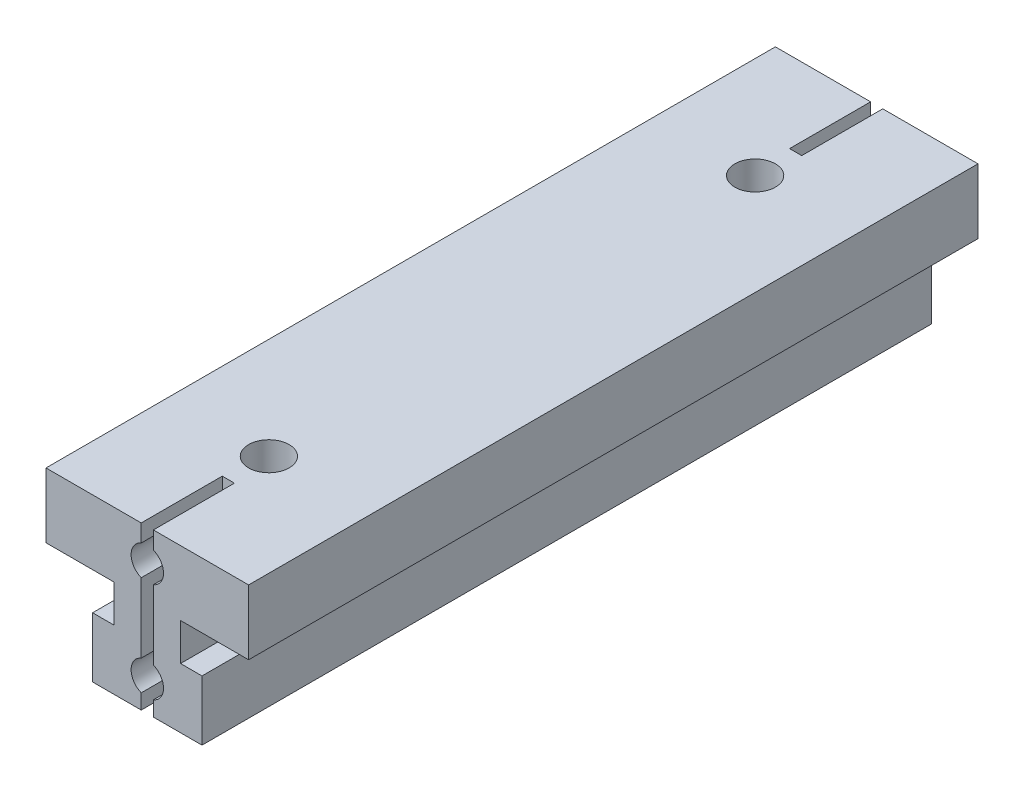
ISO-10303-21;
HEADER;
FILE_DESCRIPTION(('STEP AP214'),'2;1');
FILE_NAME('part.step','',(''),(''),'','','');
FILE_SCHEMA(('AUTOMOTIVE_DESIGN { 1 0 10303 214 1 1 1 1 }'));
ENDSEC;
DATA;
#1=APPLICATION_CONTEXT('core data for automotive mechanical design processes');
#2=APPLICATION_PROTOCOL_DEFINITION('international standard','automotive_design',2000,#1);
#3=PRODUCT_CONTEXT('',#1,'mechanical');
#4=PRODUCT('Part','Part','',(#3));
#5=PRODUCT_RELATED_PRODUCT_CATEGORY('part','',(#4));
#6=PRODUCT_DEFINITION_FORMATION('','',#4);
#7=PRODUCT_DEFINITION_CONTEXT('part definition',#1,'design');
#8=PRODUCT_DEFINITION('design','',#6,#7);
#9=PRODUCT_DEFINITION_SHAPE('','',#8);
#10=(LENGTH_UNIT() NAMED_UNIT(*) SI_UNIT(.MILLI.,.METRE.));
#11=(NAMED_UNIT(*) PLANE_ANGLE_UNIT() SI_UNIT($,.RADIAN.));
#12=(NAMED_UNIT(*) SI_UNIT($,.STERADIAN.) SOLID_ANGLE_UNIT());
#13=UNCERTAINTY_MEASURE_WITH_UNIT(LENGTH_MEASURE(1.E-05),#10,'distance_accuracy_value','');
#14=(GEOMETRIC_REPRESENTATION_CONTEXT(3) GLOBAL_UNCERTAINTY_ASSIGNED_CONTEXT((#13)) GLOBAL_UNIT_ASSIGNED_CONTEXT((#10,
#11,#12)) REPRESENTATION_CONTEXT('',''));
#15=CARTESIAN_POINT('',(0.,0.,0.));
#16=DIRECTION('',(0.,0.,1.));
#17=DIRECTION('',(1.,0.,0.));
#18=AXIS2_PLACEMENT_3D('',#15,#16,#17);
#19=CARTESIAN_POINT('',(-2.04,8.,-35.));
#20=DIRECTION('',(0.,0.,-1.));
#21=DIRECTION('',(1.,0.,0.));
#22=AXIS2_PLACEMENT_3D('',#19,#20,#21);
#23=PLANE('',#22);
#24=DIRECTION('',(0.,-1.,0.));
#25=VECTOR('',#24,1.);
#26=CARTESIAN_POINT('',(0.75,-2.14999961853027,-35.));
#27=LINE('',#26,#25);
#28=CARTESIAN_POINT('',(0.749999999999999,2.1459503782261,-35.));
#29=VERTEX_POINT('',#28);
#30=CARTESIAN_POINT('',(0.75,-6.44594961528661,-35.));
#31=VERTEX_POINT('',#30);
#32=EDGE_CURVE('E419',#29,#31,#27,.T.);
#33=ORIENTED_EDGE('',*,*,#32,.T.);
#34=CARTESIAN_POINT('',(0.,-8.2999992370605,-35.));
#35=DIRECTION('',(0.,0.,1.));
#36=DIRECTION('',(0.,-1.,0.));
#37=AXIS2_PLACEMENT_3D('',#34,#35,#36);
#38=CIRCLE('',#37,2.);
#39=CARTESIAN_POINT('',(0.749999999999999,-10.1540488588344,-35.));
#40=VERTEX_POINT('',#39);
#41=EDGE_CURVE('E319',#31,#40,#38,.F.);
#42=ORIENTED_EDGE('',*,*,#41,.T.);
#43=DIRECTION('',(0.,-1.,0.));
#44=VECTOR('',#43,1.);
#45=CARTESIAN_POINT('',(0.75,-11.0770244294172,-35.));
#46=LINE('',#45,#44);
#47=CARTESIAN_POINT('',(0.75,-12.,-35.));
#48=VERTEX_POINT('',#47);
#49=EDGE_CURVE('E417',#40,#48,#46,.T.);
#50=ORIENTED_EDGE('',*,*,#49,.T.);
#51=DIRECTION('',(1.,0.,0.));
#52=VECTOR('',#51,1.);
#53=CARTESIAN_POINT('',(6.75,-12.,-35.));
#54=LINE('',#53,#52);
#55=CARTESIAN_POINT('',(-0.75,-12.,-35.));
#56=VERTEX_POINT('',#55);
#57=EDGE_CURVE('E394',#56,#48,#54,.T.);
#58=ORIENTED_EDGE('',*,*,#57,.F.);
#59=DIRECTION('',(0.,1.,0.));
#60=VECTOR('',#59,1.);
#61=CARTESIAN_POINT('',(-0.75,-11.0770244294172,-35.));
#62=LINE('',#61,#60);
#63=CARTESIAN_POINT('',(-0.75,-10.1540488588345,-35.));
#64=VERTEX_POINT('',#63);
#65=EDGE_CURVE('E248',#56,#64,#62,.T.);
#66=ORIENTED_EDGE('',*,*,#65,.T.);
#67=CARTESIAN_POINT('',(0.,-8.29999923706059,-35.));
#68=DIRECTION('',(0.,0.,1.));
#69=DIRECTION('',(0.,-1.,0.));
#70=AXIS2_PLACEMENT_3D('',#67,#68,#69);
#71=CIRCLE('',#70,2.);
#72=CARTESIAN_POINT('',(-0.75,-6.44594961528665,-35.));
#73=VERTEX_POINT('',#72);
#74=EDGE_CURVE('E20',#64,#73,#71,.F.);
#75=ORIENTED_EDGE('',*,*,#74,.T.);
#76=DIRECTION('',(0.,1.,0.));
#77=VECTOR('',#76,1.);
#78=CARTESIAN_POINT('',(-0.75,-2.14999961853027,-35.));
#79=LINE('',#78,#77);
#80=CARTESIAN_POINT('',(-0.75,2.14595037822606,-35.));
#81=VERTEX_POINT('',#80);
#82=EDGE_CURVE('E253',#73,#81,#79,.T.);
#83=ORIENTED_EDGE('',*,*,#82,.T.);
#84=CARTESIAN_POINT('',(0.,3.99999999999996,-35.));
#85=DIRECTION('',(0.,0.,1.));
#86=DIRECTION('',(0.,-1.,0.));
#87=AXIS2_PLACEMENT_3D('',#84,#85,#86);
#88=CIRCLE('',#87,2.);
#89=CARTESIAN_POINT('',(-0.75,5.8540496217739,-35.));
#90=VERTEX_POINT('',#89);
#91=EDGE_CURVE('E271',#81,#90,#88,.F.);
#92=ORIENTED_EDGE('',*,*,#91,.T.);
#93=DIRECTION('',(0.,1.,0.));
#94=VECTOR('',#93,1.);
#95=CARTESIAN_POINT('',(-0.75,6.92702481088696,-35.));
#96=LINE('',#95,#94);
#97=CARTESIAN_POINT('',(-0.75,8.,-35.));
#98=VERTEX_POINT('',#97);
#99=EDGE_CURVE('E377',#90,#98,#96,.T.);
#100=ORIENTED_EDGE('',*,*,#99,.T.);
#101=DIRECTION('',(1.,0.,0.));
#102=VECTOR('',#101,1.);
#103=CARTESIAN_POINT('',(0.,8.,-35.));
#104=LINE('',#103,#102);
#105=CARTESIAN_POINT('',(0.75,8.,-35.));
#106=VERTEX_POINT('',#105);
#107=EDGE_CURVE('E401',#98,#106,#104,.T.);
#108=ORIENTED_EDGE('',*,*,#107,.T.);
#109=DIRECTION('',(0.,-1.,0.));
#110=VECTOR('',#109,1.);
#111=CARTESIAN_POINT('',(0.75,6.92702481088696,-35.));
#112=LINE('',#111,#110);
#113=CARTESIAN_POINT('',(0.75,5.85404962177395,-35.));
#114=VERTEX_POINT('',#113);
#115=EDGE_CURVE('E383',#106,#114,#112,.T.);
#116=ORIENTED_EDGE('',*,*,#115,.T.);
#117=CARTESIAN_POINT('',(0.,4.00000000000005,-35.));
#118=DIRECTION('',(0.,0.,1.));
#119=DIRECTION('',(0.,-1.,0.));
#120=AXIS2_PLACEMENT_3D('',#117,#118,#119);
#121=CIRCLE('',#120,2.);
#122=EDGE_CURVE('E323',#114,#29,#121,.F.);
#123=ORIENTED_EDGE('',*,*,#122,.T.);
#124=EDGE_LOOP('',(#33,#42,#50,#58,#66,#75,#83,#92,#100,#108,#116,#123));
#125=FACE_BOUND('',#124,.T.);
#126=ADVANCED_FACE('F16',(#125),#23,.T.);
#127=CARTESIAN_POINT('',(-0.75,-10.1540488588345,-35.));
#128=DIRECTION('',(-1.,0.,0.));
#129=DIRECTION('',(0.,0.,-1.));
#130=AXIS2_PLACEMENT_3D('',#127,#128,#129);
#131=PLANE('',#130);
#132=DIRECTION('',(0.,0.,-1.));
#133=VECTOR('',#132,1.);
#134=CARTESIAN_POINT('',(-0.75,-12.,0.));
#135=LINE('',#134,#133);
#136=CARTESIAN_POINT('',(-0.75,-12.,-45.));
#137=VERTEX_POINT('',#136);
#138=EDGE_CURVE('E391',#137,#56,#135,.F.);
#139=ORIENTED_EDGE('',*,*,#138,.F.);
#140=DIRECTION('',(0.,1.,0.));
#141=VECTOR('',#140,1.);
#142=CARTESIAN_POINT('',(-0.75,-0.659840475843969,-45.));
#143=LINE('',#142,#141);
#144=CARTESIAN_POINT('',(-0.75,-10.1540488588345,-45.));
#145=VERTEX_POINT('',#144);
#146=EDGE_CURVE('E318',#137,#145,#143,.T.);
#147=ORIENTED_EDGE('',*,*,#146,.T.);
#148=DIRECTION('',(0.,0.,1.));
#149=VECTOR('',#148,1.);
#150=CARTESIAN_POINT('',(-0.75,-10.1540488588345,-40.));
#151=LINE('',#150,#149);
#152=EDGE_CURVE('E258',#145,#64,#151,.T.);
#153=ORIENTED_EDGE('',*,*,#152,.T.);
#154=ORIENTED_EDGE('',*,*,#65,.F.);
#155=EDGE_LOOP('',(#139,#147,#153,#154));
#156=FACE_BOUND('',#155,.T.);
#157=ADVANCED_FACE('F646',(#156),#131,.F.);
#158=CARTESIAN_POINT('',(0.,-8.29999923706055,-45.));
#159=DIRECTION('',(0.,0.,1.));
#160=DIRECTION('',(0.,-1.,0.));
#161=AXIS2_PLACEMENT_3D('',#158,#159,#160);
#162=CYLINDRICAL_SURFACE('',#161,2.);
#163=ORIENTED_EDGE('',*,*,#152,.F.);
#164=CARTESIAN_POINT('',(0.,-8.29999923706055,-45.));
#165=DIRECTION('',(0.,0.,1.));
#166=DIRECTION('',(0.,-1.,0.));
#167=AXIS2_PLACEMENT_3D('',#164,#165,#166);
#168=CIRCLE('',#167,2.);
#169=CARTESIAN_POINT('',(-0.75,-6.44594961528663,-45.));
#170=VERTEX_POINT('',#169);
#171=EDGE_CURVE('E262',#145,#170,#168,.F.);
#172=ORIENTED_EDGE('',*,*,#171,.T.);
#173=DIRECTION('',(0.,0.,1.));
#174=VECTOR('',#173,1.);
#175=CARTESIAN_POINT('',(-0.75,-6.44594961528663,-40.));
#176=LINE('',#175,#174);
#177=EDGE_CURVE('E257',#170,#73,#176,.T.);
#178=ORIENTED_EDGE('',*,*,#177,.T.);
#179=ORIENTED_EDGE('',*,*,#74,.F.);
#180=EDGE_LOOP('',(#163,#172,#178,#179));
#181=FACE_BOUND('',#180,.T.);
#182=ADVANCED_FACE('F260',(#181),#162,.F.);
#183=CARTESIAN_POINT('',(-0.75,2.14595037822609,-35.));
#184=DIRECTION('',(-1.,0.,0.));
#185=DIRECTION('',(0.,0.,-1.));
#186=AXIS2_PLACEMENT_3D('',#183,#184,#185);
#187=PLANE('',#186);
#188=ORIENTED_EDGE('',*,*,#177,.F.);
#189=DIRECTION('',(0.,1.,0.));
#190=VECTOR('',#189,1.);
#191=CARTESIAN_POINT('',(-0.75,-0.659840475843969,-45.));
#192=LINE('',#191,#190);
#193=CARTESIAN_POINT('',(-0.75,2.14595037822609,-45.));
#194=VERTEX_POINT('',#193);
#195=EDGE_CURVE('E316',#170,#194,#192,.T.);
#196=ORIENTED_EDGE('',*,*,#195,.T.);
#197=DIRECTION('',(0.,0.,1.));
#198=VECTOR('',#197,1.);
#199=CARTESIAN_POINT('',(-0.75,2.14595037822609,-40.));
#200=LINE('',#199,#198);
#201=EDGE_CURVE('E268',#194,#81,#200,.T.);
#202=ORIENTED_EDGE('',*,*,#201,.T.);
#203=ORIENTED_EDGE('',*,*,#82,.F.);
#204=EDGE_LOOP('',(#188,#196,#202,#203));
#205=FACE_BOUND('',#204,.T.);
#206=ADVANCED_FACE('F266',(#205),#187,.F.);
#207=CARTESIAN_POINT('',(0.,4.,-45.));
#208=DIRECTION('',(0.,0.,1.));
#209=DIRECTION('',(0.,-1.,0.));
#210=AXIS2_PLACEMENT_3D('',#207,#208,#209);
#211=CYLINDRICAL_SURFACE('',#210,2.);
#212=ORIENTED_EDGE('',*,*,#201,.F.);
#213=CARTESIAN_POINT('',(0.,4.,-45.));
#214=DIRECTION('',(0.,0.,1.));
#215=DIRECTION('',(0.,-1.,0.));
#216=AXIS2_PLACEMENT_3D('',#213,#214,#215);
#217=CIRCLE('',#216,2.);
#218=CARTESIAN_POINT('',(-0.75,5.85404962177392,-45.));
#219=VERTEX_POINT('',#218);
#220=EDGE_CURVE('E313',#194,#219,#217,.F.);
#221=ORIENTED_EDGE('',*,*,#220,.T.);
#222=DIRECTION('',(0.,0.,1.));
#223=VECTOR('',#222,1.);
#224=CARTESIAN_POINT('',(-0.75,5.85404962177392,-40.));
#225=LINE('',#224,#223);
#226=EDGE_CURVE('E381',#219,#90,#225,.T.);
#227=ORIENTED_EDGE('',*,*,#226,.T.);
#228=ORIENTED_EDGE('',*,*,#91,.F.);
#229=EDGE_LOOP('',(#212,#221,#227,#228));
#230=FACE_BOUND('',#229,.T.);
#231=ADVANCED_FACE('F752',(#230),#211,.F.);
#232=CARTESIAN_POINT('',(-4.10000610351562,0.,0.));
#233=DIRECTION('',(0.,-1.,0.));
#234=DIRECTION('',(0.,0.,-1.));
#235=AXIS2_PLACEMENT_3D('',#232,#233,#234);
#236=PLANE('',#235);
#237=DIRECTION('',(1.,0.,0.));
#238=VECTOR('',#237,1.);
#239=CARTESIAN_POINT('',(0.,0.,-45.));
#240=LINE('',#239,#238);
#241=CARTESIAN_POINT('',(-12.5,0.,-45.));
#242=VERTEX_POINT('',#241);
#243=CARTESIAN_POINT('',(-4.10000610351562,0.,-45.));
#244=VERTEX_POINT('',#243);
#245=EDGE_CURVE('E374',#242,#244,#240,.T.);
#246=ORIENTED_EDGE('',*,*,#245,.T.);
#247=DIRECTION('',(0.,0.,1.));
#248=VECTOR('',#247,1.);
#249=CARTESIAN_POINT('',(-4.10000610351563,0.,0.));
#250=LINE('',#249,#248);
#251=CARTESIAN_POINT('',(-4.10000610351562,0.,45.));
#252=VERTEX_POINT('',#251);
#253=EDGE_CURVE('E343',#252,#244,#250,.F.);
#254=ORIENTED_EDGE('',*,*,#253,.F.);
#255=DIRECTION('',(1.,0.,0.));
#256=VECTOR('',#255,1.);
#257=CARTESIAN_POINT('',(0.,0.,45.));
#258=LINE('',#257,#256);
#259=CARTESIAN_POINT('',(-12.5,0.,45.));
#260=VERTEX_POINT('',#259);
#261=EDGE_CURVE('E358',#260,#252,#258,.T.);
#262=ORIENTED_EDGE('',*,*,#261,.F.);
#263=DIRECTION('',(0.,0.,1.));
#264=VECTOR('',#263,1.);
#265=CARTESIAN_POINT('',(-12.5,0.,0.));
#266=LINE('',#265,#264);
#267=EDGE_CURVE('E364',#242,#260,#266,.T.);
#268=ORIENTED_EDGE('',*,*,#267,.F.);
#269=EDGE_LOOP('',(#246,#254,#262,#268));
#270=FACE_BOUND('',#269,.T.);
#271=ADVANCED_FACE('F640',(#270),#236,.T.);
#272=CARTESIAN_POINT('',(-4.10000610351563,-4.59999847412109,0.));
#273=DIRECTION('',(-1.,0.,0.));
#274=DIRECTION('',(0.,0.,1.));
#275=AXIS2_PLACEMENT_3D('',#272,#273,#274);
#276=PLANE('',#275);
#277=DIRECTION('',(0.,1.,0.));
#278=VECTOR('',#277,1.);
#279=CARTESIAN_POINT('',(-4.10000610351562,-0.659840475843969,-45.));
#280=LINE('',#279,#278);
#281=CARTESIAN_POINT('',(-4.10000610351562,-4.59999847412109,-45.));
#282=VERTEX_POINT('',#281);
#283=EDGE_CURVE('E376',#244,#282,#280,.F.);
#284=ORIENTED_EDGE('',*,*,#283,.T.);
#285=DIRECTION('',(0.,0.,1.));
#286=VECTOR('',#285,1.);
#287=CARTESIAN_POINT('',(-4.10000610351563,-4.59999847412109,0.));
#288=LINE('',#287,#286);
#289=CARTESIAN_POINT('',(-4.10000610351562,-4.59999847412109,45.));
#290=VERTEX_POINT('',#289);
#291=EDGE_CURVE('E347',#290,#282,#288,.F.);
#292=ORIENTED_EDGE('',*,*,#291,.F.);
#293=DIRECTION('',(0.,1.,0.));
#294=VECTOR('',#293,1.);
#295=CARTESIAN_POINT('',(-4.10000610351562,-0.659840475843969,45.));
#296=LINE('',#295,#294);
#297=EDGE_CURVE('E357',#252,#290,#296,.F.);
#298=ORIENTED_EDGE('',*,*,#297,.F.);
#299=ORIENTED_EDGE('',*,*,#253,.T.);
#300=EDGE_LOOP('',(#284,#292,#298,#299));
#301=FACE_BOUND('',#300,.T.);
#302=ADVANCED_FACE('F491',(#301),#276,.T.);
#303=CARTESIAN_POINT('',(-6.75,-4.59999847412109,0.));
#304=DIRECTION('',(0.,1.,0.));
#305=DIRECTION('',(0.,0.,1.));
#306=AXIS2_PLACEMENT_3D('',#303,#304,#305);
#307=PLANE('',#306);
#308=DIRECTION('',(1.,0.,0.));
#309=VECTOR('',#308,1.);
#310=CARTESIAN_POINT('',(0.,-4.59999847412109,-45.));
#311=LINE('',#310,#309);
#312=CARTESIAN_POINT('',(-6.75,-4.59999847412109,-45.));
#313=VERTEX_POINT('',#312);
#314=EDGE_CURVE('E397',#282,#313,#311,.F.);
#315=ORIENTED_EDGE('',*,*,#314,.T.);
#316=DIRECTION('',(0.,0.,1.));
#317=VECTOR('',#316,1.);
#318=CARTESIAN_POINT('',(-6.75,-4.59999847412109,0.));
#319=LINE('',#318,#317);
#320=CARTESIAN_POINT('',(-6.75,-4.59999847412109,45.));
#321=VERTEX_POINT('',#320);
#322=EDGE_CURVE('E353',#321,#313,#319,.F.);
#323=ORIENTED_EDGE('',*,*,#322,.F.);
#324=DIRECTION('',(1.,0.,0.));
#325=VECTOR('',#324,1.);
#326=CARTESIAN_POINT('',(0.,-4.59999847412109,45.));
#327=LINE('',#326,#325);
#328=EDGE_CURVE('E481',#290,#321,#327,.F.);
#329=ORIENTED_EDGE('',*,*,#328,.F.);
#330=ORIENTED_EDGE('',*,*,#291,.T.);
#331=EDGE_LOOP('',(#315,#323,#329,#330));
#332=FACE_BOUND('',#331,.T.);
#333=ADVANCED_FACE('F494',(#332),#307,.T.);
#334=CARTESIAN_POINT('',(-6.75,-12.,0.));
#335=DIRECTION('',(-1.,0.,0.));
#336=DIRECTION('',(0.,0.,1.));
#337=AXIS2_PLACEMENT_3D('',#334,#335,#336);
#338=PLANE('',#337);
#339=DIRECTION('',(0.,1.,0.));
#340=VECTOR('',#339,1.);
#341=CARTESIAN_POINT('',(-6.75,-0.659840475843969,-45.));
#342=LINE('',#341,#340);
#343=CARTESIAN_POINT('',(-6.75,-12.,-45.));
#344=VERTEX_POINT('',#343);
#345=EDGE_CURVE('E390',#313,#344,#342,.F.);
#346=ORIENTED_EDGE('',*,*,#345,.T.);
#347=DIRECTION('',(0.,0.,-1.));
#348=VECTOR('',#347,1.);
#349=CARTESIAN_POINT('',(-6.75,-12.,0.));
#350=LINE('',#349,#348);
#351=CARTESIAN_POINT('',(-6.75,-12.,45.));
#352=VERTEX_POINT('',#351);
#353=EDGE_CURVE('E395',#352,#344,#350,.T.);
#354=ORIENTED_EDGE('',*,*,#353,.F.);
#355=DIRECTION('',(0.,1.,0.));
#356=VECTOR('',#355,1.);
#357=CARTESIAN_POINT('',(-6.75,-0.659840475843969,45.));
#358=LINE('',#357,#356);
#359=EDGE_CURVE('E475',#321,#352,#358,.F.);
#360=ORIENTED_EDGE('',*,*,#359,.F.);
#361=ORIENTED_EDGE('',*,*,#322,.T.);
#362=EDGE_LOOP('',(#346,#354,#360,#361));
#363=FACE_BOUND('',#362,.T.);
#364=ADVANCED_FACE('F498',(#363),#338,.T.);
#365=CARTESIAN_POINT('',(-0.75,-10.1540488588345,45.));
#366=DIRECTION('',(-1.,0.,0.));
#367=DIRECTION('',(0.,0.,1.));
#368=AXIS2_PLACEMENT_3D('',#365,#366,#367);
#369=PLANE('',#368);
#370=DIRECTION('',(0.,0.,-1.));
#371=VECTOR('',#370,1.);
#372=CARTESIAN_POINT('',(-0.749999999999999,-10.1540488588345,45.));
#373=LINE('',#372,#371);
#374=CARTESIAN_POINT('',(-0.75,-10.1540488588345,35.));
#375=VERTEX_POINT('',#374);
#376=CARTESIAN_POINT('',(-0.75,-10.1540488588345,45.));
#377=VERTEX_POINT('',#376);
#378=EDGE_CURVE('E470',#375,#377,#373,.F.);
#379=ORIENTED_EDGE('',*,*,#378,.T.);
#380=DIRECTION('',(0.,1.,0.));
#381=VECTOR('',#380,1.);
#382=CARTESIAN_POINT('',(-0.75,-0.659840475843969,45.));
#383=LINE('',#382,#381);
#384=CARTESIAN_POINT('',(-0.75,-12.,45.));
#385=VERTEX_POINT('',#384);
#386=EDGE_CURVE('E312',#385,#377,#383,.T.);
#387=ORIENTED_EDGE('',*,*,#386,.F.);
#388=DIRECTION('',(0.,0.,-1.));
#389=VECTOR('',#388,1.);
#390=CARTESIAN_POINT('',(-0.75,-12.,0.));
#391=LINE('',#390,#389);
#392=CARTESIAN_POINT('',(-0.75,-12.,35.));
#393=VERTEX_POINT('',#392);
#394=EDGE_CURVE('E413',#393,#385,#391,.F.);
#395=ORIENTED_EDGE('',*,*,#394,.F.);
#396=DIRECTION('',(0.,1.,0.));
#397=VECTOR('',#396,1.);
#398=CARTESIAN_POINT('',(-0.75,-2.0132024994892,35.));
#399=LINE('',#398,#397);
#400=EDGE_CURVE('E335',#375,#393,#399,.F.);
#401=ORIENTED_EDGE('',*,*,#400,.F.);
#402=EDGE_LOOP('',(#379,#387,#395,#401));
#403=FACE_BOUND('',#402,.T.);
#404=ADVANCED_FACE('F509',(#403),#369,.F.);
#405=CARTESIAN_POINT('',(0.,-8.29999923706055,45.));
#406=DIRECTION('',(0.,0.,-1.));
#407=DIRECTION('',(-1.,0.,0.));
#408=AXIS2_PLACEMENT_3D('',#405,#406,#407);
#409=CYLINDRICAL_SURFACE('',#408,2.);
#410=DIRECTION('',(0.,0.,1.));
#411=VECTOR('',#410,1.);
#412=CARTESIAN_POINT('',(-0.75,-6.44594961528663,45.));
#413=LINE('',#412,#411);
#414=CARTESIAN_POINT('',(-0.75,-6.44594961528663,35.));
#415=VERTEX_POINT('',#414);
#416=CARTESIAN_POINT('',(-0.75,-6.44594961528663,45.));
#417=VERTEX_POINT('',#416);
#418=EDGE_CURVE('E468',#415,#417,#413,.T.);
#419=ORIENTED_EDGE('',*,*,#418,.T.);
#420=CARTESIAN_POINT('',(0.,-8.29999923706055,45.));
#421=DIRECTION('',(0.,0.,-1.));
#422=DIRECTION('',(-1.,0.,0.));
#423=AXIS2_PLACEMENT_3D('',#420,#421,#422);
#424=CIRCLE('',#423,2.);
#425=EDGE_CURVE('E309',#377,#417,#424,.T.);
#426=ORIENTED_EDGE('',*,*,#425,.F.);
#427=ORIENTED_EDGE('',*,*,#378,.F.);
#428=CARTESIAN_POINT('',(0.,-8.29999923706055,35.));
#429=DIRECTION('',(0.,0.,-1.));
#430=DIRECTION('',(-1.,0.,0.));
#431=AXIS2_PLACEMENT_3D('',#428,#429,#430);
#432=CIRCLE('',#431,2.);
#433=EDGE_CURVE('E336',#415,#375,#432,.F.);
#434=ORIENTED_EDGE('',*,*,#433,.F.);
#435=EDGE_LOOP('',(#419,#426,#427,#434));
#436=FACE_BOUND('',#435,.T.);
#437=ADVANCED_FACE('F622',(#436),#409,.F.);
#438=CARTESIAN_POINT('',(-0.75,2.14595037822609,45.));
#439=DIRECTION('',(-1.,0.,0.));
#440=DIRECTION('',(0.,0.,1.));
#441=AXIS2_PLACEMENT_3D('',#438,#439,#440);
#442=PLANE('',#441);
#443=DIRECTION('',(0.,0.,-1.));
#444=VECTOR('',#443,1.);
#445=CARTESIAN_POINT('',(-0.749999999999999,2.14595037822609,45.));
#446=LINE('',#445,#444);
#447=CARTESIAN_POINT('',(-0.75,2.14595037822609,35.));
#448=VERTEX_POINT('',#447);
#449=CARTESIAN_POINT('',(-0.75,2.14595037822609,45.));
#450=VERTEX_POINT('',#449);
#451=EDGE_CURVE('E457',#448,#450,#446,.F.);
#452=ORIENTED_EDGE('',*,*,#451,.T.);
#453=DIRECTION('',(0.,1.,0.));
#454=VECTOR('',#453,1.);
#455=CARTESIAN_POINT('',(-0.75,-0.659840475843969,45.));
#456=LINE('',#455,#454);
#457=EDGE_CURVE('E308',#417,#450,#456,.T.);
#458=ORIENTED_EDGE('',*,*,#457,.F.);
#459=ORIENTED_EDGE('',*,*,#418,.F.);
#460=DIRECTION('',(0.,1.,0.));
#461=VECTOR('',#460,1.);
#462=CARTESIAN_POINT('',(-0.75,-2.0132024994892,35.));
#463=LINE('',#462,#461);
#464=EDGE_CURVE('E339',#448,#415,#463,.F.);
#465=ORIENTED_EDGE('',*,*,#464,.F.);
#466=EDGE_LOOP('',(#452,#458,#459,#465));
#467=FACE_BOUND('',#466,.T.);
#468=ADVANCED_FACE('F627',(#467),#442,.F.);
#469=CARTESIAN_POINT('',(0.,4.,45.));
#470=DIRECTION('',(0.,0.,-1.));
#471=DIRECTION('',(-1.,0.,0.));
#472=AXIS2_PLACEMENT_3D('',#469,#470,#471);
#473=CYLINDRICAL_SURFACE('',#472,2.);
#474=DIRECTION('',(0.,0.,1.));
#475=VECTOR('',#474,1.);
#476=CARTESIAN_POINT('',(-0.75,5.85404962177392,45.));
#477=LINE('',#476,#475);
#478=CARTESIAN_POINT('',(-0.75,5.85404962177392,35.));
#479=VERTEX_POINT('',#478);
#480=CARTESIAN_POINT('',(-0.75,5.85404962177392,45.));
#481=VERTEX_POINT('',#480);
#482=EDGE_CURVE('E307',#479,#481,#477,.T.);
#483=ORIENTED_EDGE('',*,*,#482,.T.);
#484=CARTESIAN_POINT('',(0.,4.,45.));
#485=DIRECTION('',(0.,0.,-1.));
#486=DIRECTION('',(-1.,0.,0.));
#487=AXIS2_PLACEMENT_3D('',#484,#485,#486);
#488=CIRCLE('',#487,2.);
#489=EDGE_CURVE('E304',#450,#481,#488,.T.);
#490=ORIENTED_EDGE('',*,*,#489,.F.);
#491=ORIENTED_EDGE('',*,*,#451,.F.);
#492=CARTESIAN_POINT('',(0.,4.,35.));
#493=DIRECTION('',(0.,0.,-1.));
#494=DIRECTION('',(-1.,0.,0.));
#495=AXIS2_PLACEMENT_3D('',#492,#493,#494);
#496=CIRCLE('',#495,2.);
#497=EDGE_CURVE('E340',#479,#448,#496,.F.);
#498=ORIENTED_EDGE('',*,*,#497,.F.);
#499=EDGE_LOOP('',(#483,#490,#491,#498));
#500=FACE_BOUND('',#499,.T.);
#501=ADVANCED_FACE('F629',(#500),#473,.F.);
#502=CARTESIAN_POINT('',(0.,-2.0132024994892,35.));
#503=DIRECTION('',(0.,0.,1.));
#504=DIRECTION('',(1.,0.,0.));
#505=AXIS2_PLACEMENT_3D('',#502,#503,#504);
#506=PLANE('',#505);
#507=ORIENTED_EDGE('',*,*,#400,.T.);
#508=DIRECTION('',(1.,0.,0.));
#509=VECTOR('',#508,1.);
#510=CARTESIAN_POINT('',(6.75,-12.,35.));
#511=LINE('',#510,#509);
#512=CARTESIAN_POINT('',(0.75,-12.,35.));
#513=VERTEX_POINT('',#512);
#514=EDGE_CURVE('E410',#513,#393,#511,.F.);
#515=ORIENTED_EDGE('',*,*,#514,.F.);
#516=DIRECTION('',(0.,1.,0.));
#517=VECTOR('',#516,1.);
#518=CARTESIAN_POINT('',(0.75,-12.,35.));
#519=LINE('',#518,#517);
#520=CARTESIAN_POINT('',(0.75,-10.1540488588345,35.));
#521=VERTEX_POINT('',#520);
#522=EDGE_CURVE('E326',#513,#521,#519,.T.);
#523=ORIENTED_EDGE('',*,*,#522,.T.);
#524=CARTESIAN_POINT('',(0.,-8.29999923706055,35.));
#525=DIRECTION('',(0.,0.,-1.));
#526=DIRECTION('',(-1.,0.,0.));
#527=AXIS2_PLACEMENT_3D('',#524,#525,#526);
#528=CIRCLE('',#527,2.);
#529=CARTESIAN_POINT('',(0.75,-6.44594961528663,35.));
#530=VERTEX_POINT('',#529);
#531=EDGE_CURVE('E327',#521,#530,#528,.F.);
#532=ORIENTED_EDGE('',*,*,#531,.T.);
#533=DIRECTION('',(0.,1.,0.));
#534=VECTOR('',#533,1.);
#535=CARTESIAN_POINT('',(0.75,-6.44594961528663,35.));
#536=LINE('',#535,#534);
#537=CARTESIAN_POINT('',(0.75,2.14595037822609,35.));
#538=VERTEX_POINT('',#537);
#539=EDGE_CURVE('E274',#530,#538,#536,.T.);
#540=ORIENTED_EDGE('',*,*,#539,.T.);
#541=CARTESIAN_POINT('',(0.,4.,35.));
#542=DIRECTION('',(0.,0.,-1.));
#543=DIRECTION('',(-1.,0.,0.));
#544=AXIS2_PLACEMENT_3D('',#541,#542,#543);
#545=CIRCLE('',#544,2.);
#546=CARTESIAN_POINT('',(0.749999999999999,5.85404962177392,35.));
#547=VERTEX_POINT('',#546);
#548=EDGE_CURVE('E332',#538,#547,#545,.F.);
#549=ORIENTED_EDGE('',*,*,#548,.T.);
#550=DIRECTION('',(0.,1.,0.));
#551=VECTOR('',#550,1.);
#552=CARTESIAN_POINT('',(0.749999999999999,5.85404962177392,35.));
#553=LINE('',#552,#551);
#554=CARTESIAN_POINT('',(0.75,8.,35.));
#555=VERTEX_POINT('',#554);
#556=EDGE_CURVE('E441',#547,#555,#553,.T.);
#557=ORIENTED_EDGE('',*,*,#556,.T.);
#558=DIRECTION('',(1.,0.,0.));
#559=VECTOR('',#558,1.);
#560=CARTESIAN_POINT('',(0.,8.,35.));
#561=LINE('',#560,#559);
#562=CARTESIAN_POINT('',(-0.75,8.,35.));
#563=VERTEX_POINT('',#562);
#564=EDGE_CURVE('E342',#555,#563,#561,.F.);
#565=ORIENTED_EDGE('',*,*,#564,.T.);
#566=DIRECTION('',(0.,1.,0.));
#567=VECTOR('',#566,1.);
#568=CARTESIAN_POINT('',(-0.75,8.,35.));
#569=LINE('',#568,#567);
#570=EDGE_CURVE('E442',#563,#479,#569,.F.);
#571=ORIENTED_EDGE('',*,*,#570,.T.);
#572=ORIENTED_EDGE('',*,*,#497,.T.);
#573=ORIENTED_EDGE('',*,*,#464,.T.);
#574=ORIENTED_EDGE('',*,*,#433,.T.);
#575=EDGE_LOOP('',(#507,#515,#523,#532,#540,#549,#557,#565,#571,#572,#573,#574));
#576=FACE_BOUND('',#575,.T.);
#577=ADVANCED_FACE('F618',(#576),#506,.T.);
#578=CARTESIAN_POINT('',(0.,4.,45.));
#579=DIRECTION('',(0.,0.,-1.));
#580=DIRECTION('',(-1.,0.,0.));
#581=AXIS2_PLACEMENT_3D('',#578,#579,#580);
#582=CYLINDRICAL_SURFACE('',#581,2.);
#583=DIRECTION('',(0.,0.,-1.));
#584=VECTOR('',#583,1.);
#585=CARTESIAN_POINT('',(0.75,2.14595037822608,45.));
#586=LINE('',#585,#584);
#587=CARTESIAN_POINT('',(0.75,2.14595037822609,45.));
#588=VERTEX_POINT('',#587);
#589=EDGE_CURVE('E334',#538,#588,#586,.F.);
#590=ORIENTED_EDGE('',*,*,#589,.T.);
#591=CARTESIAN_POINT('',(0.,4.,45.));
#592=DIRECTION('',(0.,0.,-1.));
#593=DIRECTION('',(-1.,0.,0.));
#594=AXIS2_PLACEMENT_3D('',#591,#592,#593);
#595=CIRCLE('',#594,2.);
#596=CARTESIAN_POINT('',(0.75,5.85404962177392,45.));
#597=VERTEX_POINT('',#596);
#598=EDGE_CURVE('E300',#597,#588,#595,.T.);
#599=ORIENTED_EDGE('',*,*,#598,.F.);
#600=DIRECTION('',(0.,0.,-1.));
#601=VECTOR('',#600,1.);
#602=CARTESIAN_POINT('',(0.749999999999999,5.85404962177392,45.));
#603=LINE('',#602,#601);
#604=EDGE_CURVE('E438',#597,#547,#603,.T.);
#605=ORIENTED_EDGE('',*,*,#604,.T.);
#606=ORIENTED_EDGE('',*,*,#548,.F.);
#607=EDGE_LOOP('',(#590,#599,#605,#606));
#608=FACE_BOUND('',#607,.T.);
#609=ADVANCED_FACE('F577',(#608),#582,.F.);
#610=CARTESIAN_POINT('',(0.75,-6.44594961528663,45.));
#611=DIRECTION('',(1.,0.,0.));
#612=DIRECTION('',(0.,0.,-1.));
#613=AXIS2_PLACEMENT_3D('',#610,#611,#612);
#614=PLANE('',#613);
#615=DIRECTION('',(0.,0.,-1.));
#616=VECTOR('',#615,1.);
#617=CARTESIAN_POINT('',(0.75,-6.44594961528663,45.));
#618=LINE('',#617,#616);
#619=CARTESIAN_POINT('',(0.75,-6.44594961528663,45.));
#620=VERTEX_POINT('',#619);
#621=EDGE_CURVE('E331',#530,#620,#618,.F.);
#622=ORIENTED_EDGE('',*,*,#621,.T.);
#623=DIRECTION('',(0.,1.,0.));
#624=VECTOR('',#623,1.);
#625=CARTESIAN_POINT('',(0.75,-0.659840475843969,45.));
#626=LINE('',#625,#624);
#627=EDGE_CURVE('E299',#588,#620,#626,.F.);
#628=ORIENTED_EDGE('',*,*,#627,.F.);
#629=ORIENTED_EDGE('',*,*,#589,.F.);
#630=ORIENTED_EDGE('',*,*,#539,.F.);
#631=EDGE_LOOP('',(#622,#628,#629,#630));
#632=FACE_BOUND('',#631,.T.);
#633=ADVANCED_FACE('F582',(#632),#614,.F.);
#634=CARTESIAN_POINT('',(0.,-8.29999923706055,45.));
#635=DIRECTION('',(0.,0.,-1.));
#636=DIRECTION('',(-1.,0.,0.));
#637=AXIS2_PLACEMENT_3D('',#634,#635,#636);
#638=CYLINDRICAL_SURFACE('',#637,2.);
#639=DIRECTION('',(0.,0.,-1.));
#640=VECTOR('',#639,1.);
#641=CARTESIAN_POINT('',(0.75,-10.1540488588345,45.));
#642=LINE('',#641,#640);
#643=CARTESIAN_POINT('',(0.75,-10.1540488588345,45.));
#644=VERTEX_POINT('',#643);
#645=EDGE_CURVE('E330',#521,#644,#642,.F.);
#646=ORIENTED_EDGE('',*,*,#645,.T.);
#647=CARTESIAN_POINT('',(0.,-8.29999923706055,45.));
#648=DIRECTION('',(0.,0.,-1.));
#649=DIRECTION('',(-1.,0.,0.));
#650=AXIS2_PLACEMENT_3D('',#647,#648,#649);
#651=CIRCLE('',#650,2.);
#652=EDGE_CURVE('E295',#620,#644,#651,.T.);
#653=ORIENTED_EDGE('',*,*,#652,.F.);
#654=ORIENTED_EDGE('',*,*,#621,.F.);
#655=ORIENTED_EDGE('',*,*,#531,.F.);
#656=EDGE_LOOP('',(#646,#653,#654,#655));
#657=FACE_BOUND('',#656,.T.);
#658=ADVANCED_FACE('F587',(#657),#638,.F.);
#659=CARTESIAN_POINT('',(0.75,-12.,45.));
#660=DIRECTION('',(1.,0.,0.));
#661=DIRECTION('',(0.,0.,-1.));
#662=AXIS2_PLACEMENT_3D('',#659,#660,#661);
#663=PLANE('',#662);
#664=DIRECTION('',(0.,0.,-1.));
#665=VECTOR('',#664,1.);
#666=CARTESIAN_POINT('',(0.75,-12.,0.));
#667=LINE('',#666,#665);
#668=CARTESIAN_POINT('',(0.749999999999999,-12.,45.));
#669=VERTEX_POINT('',#668);
#670=EDGE_CURVE('E414',#669,#513,#667,.T.);
#671=ORIENTED_EDGE('',*,*,#670,.F.);
#672=DIRECTION('',(0.,1.,0.));
#673=VECTOR('',#672,1.);
#674=CARTESIAN_POINT('',(0.749999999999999,-0.659840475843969,45.));
#675=LINE('',#674,#673);
#676=EDGE_CURVE('E298',#644,#669,#675,.F.);
#677=ORIENTED_EDGE('',*,*,#676,.F.);
#678=ORIENTED_EDGE('',*,*,#645,.F.);
#679=ORIENTED_EDGE('',*,*,#522,.F.);
#680=EDGE_LOOP('',(#671,#677,#678,#679));
#681=FACE_BOUND('',#680,.T.);
#682=ADVANCED_FACE('F590',(#681),#663,.F.);
#683=CARTESIAN_POINT('',(0.,4.,-45.));
#684=DIRECTION('',(0.,0.,1.));
#685=DIRECTION('',(0.,-1.,0.));
#686=AXIS2_PLACEMENT_3D('',#683,#684,#685);
#687=CYLINDRICAL_SURFACE('',#686,2.);
#688=DIRECTION('',(0.,0.,-1.));
#689=VECTOR('',#688,1.);
#690=CARTESIAN_POINT('',(0.75,5.85404962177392,-40.));
#691=LINE('',#690,#689);
#692=CARTESIAN_POINT('',(0.75,5.85404962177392,-45.));
#693=VERTEX_POINT('',#692);
#694=EDGE_CURVE('E405',#114,#693,#691,.T.);
#695=ORIENTED_EDGE('',*,*,#694,.T.);
#696=CARTESIAN_POINT('',(0.,4.,-45.));
#697=DIRECTION('',(0.,0.,1.));
#698=DIRECTION('',(0.,-1.,0.));
#699=AXIS2_PLACEMENT_3D('',#696,#697,#698);
#700=CIRCLE('',#699,2.);
#701=CARTESIAN_POINT('',(0.749999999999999,2.14595037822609,-45.));
#702=VERTEX_POINT('',#701);
#703=EDGE_CURVE('E292',#693,#702,#700,.F.);
#704=ORIENTED_EDGE('',*,*,#703,.T.);
#705=DIRECTION('',(0.,0.,1.));
#706=VECTOR('',#705,1.);
#707=CARTESIAN_POINT('',(0.749999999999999,2.14595037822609,-40.));
#708=LINE('',#707,#706);
#709=EDGE_CURVE('E325',#702,#29,#708,.T.);
#710=ORIENTED_EDGE('',*,*,#709,.T.);
#711=ORIENTED_EDGE('',*,*,#122,.F.);
#712=EDGE_LOOP('',(#695,#704,#710,#711));
#713=FACE_BOUND('',#712,.T.);
#714=ADVANCED_FACE('F666',(#713),#687,.F.);
#715=CARTESIAN_POINT('',(0.749999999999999,2.14595037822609,-45.));
#716=DIRECTION('',(1.,0.,0.));
#717=DIRECTION('',(0.,0.,1.));
#718=AXIS2_PLACEMENT_3D('',#715,#716,#717);
#719=PLANE('',#718);
#720=ORIENTED_EDGE('',*,*,#709,.F.);
#721=DIRECTION('',(0.,1.,0.));
#722=VECTOR('',#721,1.);
#723=CARTESIAN_POINT('',(0.75,-0.659840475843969,-45.));
#724=LINE('',#723,#722);
#725=CARTESIAN_POINT('',(0.75,-6.44594961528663,-45.));
#726=VERTEX_POINT('',#725);
#727=EDGE_CURVE('E291',#702,#726,#724,.F.);
#728=ORIENTED_EDGE('',*,*,#727,.T.);
#729=DIRECTION('',(0.,0.,1.));
#730=VECTOR('',#729,1.);
#731=CARTESIAN_POINT('',(0.75,-6.44594961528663,-40.));
#732=LINE('',#731,#730);
#733=EDGE_CURVE('E322',#726,#31,#732,.T.);
#734=ORIENTED_EDGE('',*,*,#733,.T.);
#735=ORIENTED_EDGE('',*,*,#32,.F.);
#736=EDGE_LOOP('',(#720,#728,#734,#735));
#737=FACE_BOUND('',#736,.T.);
#738=ADVANCED_FACE('F668',(#737),#719,.F.);
#739=CARTESIAN_POINT('',(0.,-8.29999923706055,-45.));
#740=DIRECTION('',(0.,0.,1.));
#741=DIRECTION('',(0.,-1.,0.));
#742=AXIS2_PLACEMENT_3D('',#739,#740,#741);
#743=CYLINDRICAL_SURFACE('',#742,2.);
#744=ORIENTED_EDGE('',*,*,#733,.F.);
#745=CARTESIAN_POINT('',(0.,-8.29999923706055,-45.));
#746=DIRECTION('',(0.,0.,1.));
#747=DIRECTION('',(0.,-1.,0.));
#748=AXIS2_PLACEMENT_3D('',#745,#746,#747);
#749=CIRCLE('',#748,2.);
#750=CARTESIAN_POINT('',(0.749999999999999,-10.1540488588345,-45.));
#751=VERTEX_POINT('',#750);
#752=EDGE_CURVE('E288',#726,#751,#749,.F.);
#753=ORIENTED_EDGE('',*,*,#752,.T.);
#754=DIRECTION('',(0.,0.,1.));
#755=VECTOR('',#754,1.);
#756=CARTESIAN_POINT('',(0.749999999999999,-10.1540488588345,-40.));
#757=LINE('',#756,#755);
#758=EDGE_CURVE('E321',#751,#40,#757,.T.);
#759=ORIENTED_EDGE('',*,*,#758,.T.);
#760=ORIENTED_EDGE('',*,*,#41,.F.);
#761=EDGE_LOOP('',(#744,#753,#759,#760));
#762=FACE_BOUND('',#761,.T.);
#763=ADVANCED_FACE('F671',(#762),#743,.F.);
#764=CARTESIAN_POINT('',(0.749999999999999,-10.1540488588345,-45.));
#765=DIRECTION('',(1.,0.,0.));
#766=DIRECTION('',(0.,0.,1.));
#767=AXIS2_PLACEMENT_3D('',#764,#765,#766);
#768=PLANE('',#767);
#769=ORIENTED_EDGE('',*,*,#758,.F.);
#770=DIRECTION('',(0.,1.,0.));
#771=VECTOR('',#770,1.);
#772=CARTESIAN_POINT('',(0.749999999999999,-0.659840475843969,-45.));
#773=LINE('',#772,#771);
#774=CARTESIAN_POINT('',(0.749999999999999,-12.,-45.));
#775=VERTEX_POINT('',#774);
#776=EDGE_CURVE('E290',#751,#775,#773,.F.);
#777=ORIENTED_EDGE('',*,*,#776,.T.);
#778=DIRECTION('',(0.,0.,-1.));
#779=VECTOR('',#778,1.);
#780=CARTESIAN_POINT('',(0.75,-12.,0.));
#781=LINE('',#780,#779);
#782=EDGE_CURVE('E418',#48,#775,#781,.T.);
#783=ORIENTED_EDGE('',*,*,#782,.F.);
#784=ORIENTED_EDGE('',*,*,#49,.F.);
#785=EDGE_LOOP('',(#769,#777,#783,#784));
#786=FACE_BOUND('',#785,.T.);
#787=ADVANCED_FACE('F649',(#786),#768,.F.);
#788=CARTESIAN_POINT('',(6.75,-12.,0.));
#789=DIRECTION('',(0.,-1.,0.));
#790=DIRECTION('',(0.,0.,-1.));
#791=AXIS2_PLACEMENT_3D('',#788,#789,#790);
#792=PLANE('',#791);
#793=ORIENTED_EDGE('',*,*,#138,.T.);
#794=ORIENTED_EDGE('',*,*,#57,.T.);
#795=ORIENTED_EDGE('',*,*,#782,.T.);
#796=DIRECTION('',(1.,0.,0.));
#797=VECTOR('',#796,1.);
#798=CARTESIAN_POINT('',(0.,-12.,-45.));
#799=LINE('',#798,#797);
#800=CARTESIAN_POINT('',(6.75,-12.,-45.));
#801=VERTEX_POINT('',#800);
#802=EDGE_CURVE('E537',#775,#801,#799,.T.);
#803=ORIENTED_EDGE('',*,*,#802,.T.);
#804=DIRECTION('',(0.,0.,-1.));
#805=VECTOR('',#804,1.);
#806=CARTESIAN_POINT('',(6.75,-12.,0.));
#807=LINE('',#806,#805);
#808=CARTESIAN_POINT('',(6.75,-12.,45.));
#809=VERTEX_POINT('',#808);
#810=EDGE_CURVE('E409',#809,#801,#807,.T.);
#811=ORIENTED_EDGE('',*,*,#810,.F.);
#812=DIRECTION('',(1.,0.,0.));
#813=VECTOR('',#812,1.);
#814=CARTESIAN_POINT('',(0.,-12.,45.));
#815=LINE('',#814,#813);
#816=EDGE_CURVE('E430',#669,#809,#815,.T.);
#817=ORIENTED_EDGE('',*,*,#816,.F.);
#818=ORIENTED_EDGE('',*,*,#670,.T.);
#819=ORIENTED_EDGE('',*,*,#514,.T.);
#820=ORIENTED_EDGE('',*,*,#394,.T.);
#821=DIRECTION('',(1.,0.,0.));
#822=VECTOR('',#821,1.);
#823=CARTESIAN_POINT('',(0.,-12.,45.));
#824=LINE('',#823,#822);
#825=EDGE_CURVE('E472',#352,#385,#824,.T.);
#826=ORIENTED_EDGE('',*,*,#825,.F.);
#827=ORIENTED_EDGE('',*,*,#353,.T.);
#828=DIRECTION('',(1.,0.,0.));
#829=VECTOR('',#828,1.);
#830=CARTESIAN_POINT('',(0.,-12.,-45.));
#831=LINE('',#830,#829);
#832=EDGE_CURVE('E387',#344,#137,#831,.T.);
#833=ORIENTED_EDGE('',*,*,#832,.T.);
#834=EDGE_LOOP('',(#793,#794,#795,#803,#811,#817,#818,#819,#820,#826,#827,#833));
#835=FACE_BOUND('',#834,.T.);
#836=ADVANCED_FACE('F503',(#835),#792,.T.);
#837=CARTESIAN_POINT('',(6.75,-4.59999847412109,0.));
#838=DIRECTION('',(1.,0.,0.));
#839=DIRECTION('',(0.,0.,-1.));
#840=AXIS2_PLACEMENT_3D('',#837,#838,#839);
#841=PLANE('',#840);
#842=DIRECTION('',(0.,1.,0.));
#843=VECTOR('',#842,1.);
#844=CARTESIAN_POINT('',(6.75,-0.659840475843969,-45.));
#845=LINE('',#844,#843);
#846=CARTESIAN_POINT('',(6.75,-4.59999847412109,-45.));
#847=VERTEX_POINT('',#846);
#848=EDGE_CURVE('E538',#801,#847,#845,.T.);
#849=ORIENTED_EDGE('',*,*,#848,.T.);
#850=DIRECTION('',(0.,0.,1.));
#851=VECTOR('',#850,1.);
#852=CARTESIAN_POINT('',(6.75,-4.59999847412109,0.));
#853=LINE('',#852,#851);
#854=CARTESIAN_POINT('',(6.75,-4.59999847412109,45.));
#855=VERTEX_POINT('',#854);
#856=EDGE_CURVE('E529',#855,#847,#853,.F.);
#857=ORIENTED_EDGE('',*,*,#856,.F.);
#858=DIRECTION('',(0.,1.,0.));
#859=VECTOR('',#858,1.);
#860=CARTESIAN_POINT('',(6.75,-0.659840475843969,45.));
#861=LINE('',#860,#859);
#862=EDGE_CURVE('E433',#809,#855,#861,.T.);
#863=ORIENTED_EDGE('',*,*,#862,.F.);
#864=ORIENTED_EDGE('',*,*,#810,.T.);
#865=EDGE_LOOP('',(#849,#857,#863,#864));
#866=FACE_BOUND('',#865,.T.);
#867=ADVANCED_FACE('F595',(#866),#841,.T.);
#868=CARTESIAN_POINT('',(4.10000610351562,-4.59999847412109,0.));
#869=DIRECTION('',(0.,1.,0.));
#870=DIRECTION('',(0.,0.,1.));
#871=AXIS2_PLACEMENT_3D('',#868,#869,#870);
#872=PLANE('',#871);
#873=DIRECTION('',(1.,0.,0.));
#874=VECTOR('',#873,1.);
#875=CARTESIAN_POINT('',(0.,-4.59999847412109,-45.));
#876=LINE('',#875,#874);
#877=CARTESIAN_POINT('',(4.10000610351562,-4.59999847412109,-45.));
#878=VERTEX_POINT('',#877);
#879=EDGE_CURVE('E540',#847,#878,#876,.F.);
#880=ORIENTED_EDGE('',*,*,#879,.T.);
#881=DIRECTION('',(0.,0.,-1.));
#882=VECTOR('',#881,1.);
#883=CARTESIAN_POINT('',(4.10000610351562,-4.59999847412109,0.));
#884=LINE('',#883,#882);
#885=CARTESIAN_POINT('',(4.10000610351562,-4.59999847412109,45.));
#886=VERTEX_POINT('',#885);
#887=EDGE_CURVE('E526',#886,#878,#884,.T.);
#888=ORIENTED_EDGE('',*,*,#887,.F.);
#889=DIRECTION('',(1.,0.,0.));
#890=VECTOR('',#889,1.);
#891=CARTESIAN_POINT('',(0.,-4.59999847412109,45.));
#892=LINE('',#891,#890);
#893=EDGE_CURVE('E559',#855,#886,#892,.F.);
#894=ORIENTED_EDGE('',*,*,#893,.F.);
#895=ORIENTED_EDGE('',*,*,#856,.T.);
#896=EDGE_LOOP('',(#880,#888,#894,#895));
#897=FACE_BOUND('',#896,.T.);
#898=ADVANCED_FACE('F599',(#897),#872,.T.);
#899=CARTESIAN_POINT('',(4.10000610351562,0.,0.));
#900=DIRECTION('',(1.,0.,0.));
#901=DIRECTION('',(0.,0.,-1.));
#902=AXIS2_PLACEMENT_3D('',#899,#900,#901);
#903=PLANE('',#902);
#904=DIRECTION('',(0.,1.,0.));
#905=VECTOR('',#904,1.);
#906=CARTESIAN_POINT('',(4.10000610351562,-0.659840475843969,-45.));
#907=LINE('',#906,#905);
#908=CARTESIAN_POINT('',(4.10000610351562,0.,-45.));
#909=VERTEX_POINT('',#908);
#910=EDGE_CURVE('E653',#878,#909,#907,.T.);
#911=ORIENTED_EDGE('',*,*,#910,.T.);
#912=DIRECTION('',(0.,0.,-1.));
#913=VECTOR('',#912,1.);
#914=CARTESIAN_POINT('',(4.10000610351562,0.,0.));
#915=LINE('',#914,#913);
#916=CARTESIAN_POINT('',(4.10000610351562,0.,45.));
#917=VERTEX_POINT('',#916);
#918=EDGE_CURVE('E519',#917,#909,#915,.T.);
#919=ORIENTED_EDGE('',*,*,#918,.F.);
#920=DIRECTION('',(0.,1.,0.));
#921=VECTOR('',#920,1.);
#922=CARTESIAN_POINT('',(4.10000610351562,-0.659840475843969,45.));
#923=LINE('',#922,#921);
#924=EDGE_CURVE('E556',#886,#917,#923,.T.);
#925=ORIENTED_EDGE('',*,*,#924,.F.);
#926=ORIENTED_EDGE('',*,*,#887,.T.);
#927=EDGE_LOOP('',(#911,#919,#925,#926));
#928=FACE_BOUND('',#927,.T.);
#929=ADVANCED_FACE('F603',(#928),#903,.T.);
#930=CARTESIAN_POINT('',(12.5,0.,0.));
#931=DIRECTION('',(0.,-1.,0.));
#932=DIRECTION('',(0.,0.,-1.));
#933=AXIS2_PLACEMENT_3D('',#930,#931,#932);
#934=PLANE('',#933);
#935=DIRECTION('',(1.,0.,0.));
#936=VECTOR('',#935,1.);
#937=CARTESIAN_POINT('',(0.,0.,-45.));
#938=LINE('',#937,#936);
#939=CARTESIAN_POINT('',(12.5,0.,-45.));
#940=VERTEX_POINT('',#939);
#941=EDGE_CURVE('E609',#909,#940,#938,.T.);
#942=ORIENTED_EDGE('',*,*,#941,.T.);
#943=DIRECTION('',(0.,0.,-1.));
#944=VECTOR('',#943,1.);
#945=CARTESIAN_POINT('',(12.5,0.,0.));
#946=LINE('',#945,#944);
#947=CARTESIAN_POINT('',(12.5,0.,45.));
#948=VERTEX_POINT('',#947);
#949=EDGE_CURVE('E294',#948,#940,#946,.T.);
#950=ORIENTED_EDGE('',*,*,#949,.F.);
#951=DIRECTION('',(1.,0.,0.));
#952=VECTOR('',#951,1.);
#953=CARTESIAN_POINT('',(0.,0.,45.));
#954=LINE('',#953,#952);
#955=EDGE_CURVE('E554',#917,#948,#954,.T.);
#956=ORIENTED_EDGE('',*,*,#955,.F.);
#957=ORIENTED_EDGE('',*,*,#918,.T.);
#958=EDGE_LOOP('',(#942,#950,#956,#957));
#959=FACE_BOUND('',#958,.T.);
#960=ADVANCED_FACE('F607',(#959),#934,.T.);
#961=CARTESIAN_POINT('',(0.,-2.,30.));
#962=DIRECTION('',(0.,-1.,0.));
#963=DIRECTION('',(0.,0.,-1.));
#964=AXIS2_PLACEMENT_3D('',#961,#962,#963);
#965=PLANE('',#964);
#966=CARTESIAN_POINT('',(0.,-2.,30.));
#967=DIRECTION('',(0.,-1.,0.));
#968=DIRECTION('',(1.,0.,0.));
#969=AXIS2_PLACEMENT_3D('',#966,#967,#968);
#970=CIRCLE('',#969,2.5);
#971=CARTESIAN_POINT('',(2.5,-2.,30.));
#972=VERTEX_POINT('',#971);
#973=EDGE_CURVE('E284',#972,#972,#970,.F.);
#974=ORIENTED_EDGE('',*,*,#973,.T.);
#975=EDGE_LOOP('',(#974));
#976=FACE_BOUND('',#975,.T.);
#977=ADVANCED_FACE('F711',(#976),#965,.F.);
#978=CARTESIAN_POINT('',(2.55,-2.,-32.55));
#979=DIRECTION('',(0.,-1.,0.));
#980=DIRECTION('',(0.,0.,1.));
#981=AXIS2_PLACEMENT_3D('',#978,#979,#980);
#982=PLANE('',#981);
#983=CARTESIAN_POINT('',(0.,-2.,-30.));
#984=DIRECTION('',(0.,-1.,0.));
#985=DIRECTION('',(0.,0.,-1.));
#986=AXIS2_PLACEMENT_3D('',#983,#984,#985);
#987=CIRCLE('',#986,2.5);
#988=CARTESIAN_POINT('',(0.,-2.,-32.5));
#989=VERTEX_POINT('',#988);
#990=EDGE_CURVE('E280',#989,#989,#987,.F.);
#991=ORIENTED_EDGE('',*,*,#990,.T.);
#992=EDGE_LOOP('',(#991));
#993=FACE_BOUND('',#992,.T.);
#994=ADVANCED_FACE('F714',(#993),#982,.F.);
#995=CARTESIAN_POINT('',(0.75,8.,-45.));
#996=DIRECTION('',(1.,0.,0.));
#997=DIRECTION('',(0.,0.,1.));
#998=AXIS2_PLACEMENT_3D('',#995,#996,#997);
#999=PLANE('',#998);
#1000=DIRECTION('',(0.,0.,1.));
#1001=VECTOR('',#1000,1.);
#1002=CARTESIAN_POINT('',(0.750000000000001,8.,0.));
#1003=LINE('',#1002,#1001);
#1004=CARTESIAN_POINT('',(0.75,8.,-45.));
#1005=VERTEX_POINT('',#1004);
#1006=EDGE_CURVE('E283',#1005,#106,#1003,.T.);
#1007=ORIENTED_EDGE('',*,*,#1006,.F.);
#1008=DIRECTION('',(0.,1.,0.));
#1009=VECTOR('',#1008,1.);
#1010=CARTESIAN_POINT('',(0.75,-0.659840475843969,-45.));
#1011=LINE('',#1010,#1009);
#1012=EDGE_CURVE('E287',#1005,#693,#1011,.F.);
#1013=ORIENTED_EDGE('',*,*,#1012,.T.);
#1014=ORIENTED_EDGE('',*,*,#694,.F.);
#1015=ORIENTED_EDGE('',*,*,#115,.F.);
#1016=EDGE_LOOP('',(#1007,#1013,#1014,#1015));
#1017=FACE_BOUND('',#1016,.T.);
#1018=ADVANCED_FACE('F663',(#1017),#999,.F.);
#1019=CARTESIAN_POINT('',(-0.75,8.,-35.));
#1020=DIRECTION('',(-1.,0.,0.));
#1021=DIRECTION('',(0.,0.,-1.));
#1022=AXIS2_PLACEMENT_3D('',#1019,#1020,#1021);
#1023=PLANE('',#1022);
#1024=ORIENTED_EDGE('',*,*,#226,.F.);
#1025=DIRECTION('',(0.,1.,0.));
#1026=VECTOR('',#1025,1.);
#1027=CARTESIAN_POINT('',(-0.75,-0.659840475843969,-45.));
#1028=LINE('',#1027,#1026);
#1029=CARTESIAN_POINT('',(-0.75,8.,-45.));
#1030=VERTEX_POINT('',#1029);
#1031=EDGE_CURVE('E315',#219,#1030,#1028,.T.);
#1032=ORIENTED_EDGE('',*,*,#1031,.T.);
#1033=DIRECTION('',(0.,0.,1.));
#1034=VECTOR('',#1033,1.);
#1035=CARTESIAN_POINT('',(-0.750000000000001,8.,0.));
#1036=LINE('',#1035,#1034);
#1037=EDGE_CURVE('E380',#98,#1030,#1036,.F.);
#1038=ORIENTED_EDGE('',*,*,#1037,.F.);
#1039=ORIENTED_EDGE('',*,*,#99,.F.);
#1040=EDGE_LOOP('',(#1024,#1032,#1038,#1039));
#1041=FACE_BOUND('',#1040,.T.);
#1042=ADVANCED_FACE('F710',(#1041),#1023,.F.);
#1043=CARTESIAN_POINT('',(0.,-0.659840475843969,-45.));
#1044=DIRECTION('',(0.,0.,1.));
#1045=DIRECTION('',(1.,0.,0.));
#1046=AXIS2_PLACEMENT_3D('',#1043,#1044,#1045);
#1047=PLANE('',#1046);
#1048=ORIENTED_EDGE('',*,*,#220,.F.);
#1049=ORIENTED_EDGE('',*,*,#195,.F.);
#1050=ORIENTED_EDGE('',*,*,#171,.F.);
#1051=ORIENTED_EDGE('',*,*,#146,.F.);
#1052=ORIENTED_EDGE('',*,*,#832,.F.);
#1053=ORIENTED_EDGE('',*,*,#345,.F.);
#1054=ORIENTED_EDGE('',*,*,#314,.F.);
#1055=ORIENTED_EDGE('',*,*,#283,.F.);
#1056=ORIENTED_EDGE('',*,*,#245,.F.);
#1057=DIRECTION('',(0.,1.,0.));
#1058=VECTOR('',#1057,1.);
#1059=CARTESIAN_POINT('',(-12.5,0.,-45.));
#1060=LINE('',#1059,#1058);
#1061=CARTESIAN_POINT('',(-12.5,8.,-45.));
#1062=VERTEX_POINT('',#1061);
#1063=EDGE_CURVE('E366',#1062,#242,#1060,.F.);
#1064=ORIENTED_EDGE('',*,*,#1063,.F.);
#1065=DIRECTION('',(1.,0.,0.));
#1066=VECTOR('',#1065,1.);
#1067=CARTESIAN_POINT('',(-12.5,8.,-45.));
#1068=LINE('',#1067,#1066);
#1069=EDGE_CURVE('E371',#1030,#1062,#1068,.F.);
#1070=ORIENTED_EDGE('',*,*,#1069,.F.);
#1071=ORIENTED_EDGE('',*,*,#1031,.F.);
#1072=EDGE_LOOP('',(#1048,#1049,#1050,#1051,#1052,#1053,#1054,#1055,#1056,#1064,#1070,#1071));
#1073=FACE_BOUND('',#1072,.T.);
#1074=ADVANCED_FACE('F643',(#1073),#1047,.F.);
#1075=CARTESIAN_POINT('',(-12.5,0.,0.));
#1076=DIRECTION('',(-1.,0.,0.));
#1077=DIRECTION('',(0.,0.,1.));
#1078=AXIS2_PLACEMENT_3D('',#1075,#1076,#1077);
#1079=PLANE('',#1078);
#1080=ORIENTED_EDGE('',*,*,#1063,.T.);
#1081=ORIENTED_EDGE('',*,*,#267,.T.);
#1082=DIRECTION('',(0.,1.,0.));
#1083=VECTOR('',#1082,1.);
#1084=CARTESIAN_POINT('',(-12.5,-0.659840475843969,45.));
#1085=LINE('',#1084,#1083);
#1086=CARTESIAN_POINT('',(-12.5,8.,45.));
#1087=VERTEX_POINT('',#1086);
#1088=EDGE_CURVE('E361',#1087,#260,#1085,.F.);
#1089=ORIENTED_EDGE('',*,*,#1088,.F.);
#1090=DIRECTION('',(0.,0.,1.));
#1091=VECTOR('',#1090,1.);
#1092=CARTESIAN_POINT('',(-12.5,8.,0.));
#1093=LINE('',#1092,#1091);
#1094=EDGE_CURVE('E367',#1062,#1087,#1093,.T.);
#1095=ORIENTED_EDGE('',*,*,#1094,.F.);
#1096=EDGE_LOOP('',(#1080,#1081,#1089,#1095));
#1097=FACE_BOUND('',#1096,.T.);
#1098=ADVANCED_FACE('F637',(#1097),#1079,.T.);
#1099=CARTESIAN_POINT('',(0.,-0.659840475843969,45.));
#1100=DIRECTION('',(0.,0.,1.));
#1101=DIRECTION('',(1.,0.,0.));
#1102=AXIS2_PLACEMENT_3D('',#1099,#1100,#1101);
#1103=PLANE('',#1102);
#1104=ORIENTED_EDGE('',*,*,#457,.T.);
#1105=ORIENTED_EDGE('',*,*,#489,.T.);
#1106=DIRECTION('',(0.,1.,0.));
#1107=VECTOR('',#1106,1.);
#1108=CARTESIAN_POINT('',(-0.75,8.,45.));
#1109=LINE('',#1108,#1107);
#1110=CARTESIAN_POINT('',(-0.75,8.,45.));
#1111=VERTEX_POINT('',#1110);
#1112=EDGE_CURVE('E459',#481,#1111,#1109,.T.);
#1113=ORIENTED_EDGE('',*,*,#1112,.T.);
#1114=DIRECTION('',(1.,0.,0.));
#1115=VECTOR('',#1114,1.);
#1116=CARTESIAN_POINT('',(-12.5,8.,45.));
#1117=LINE('',#1116,#1115);
#1118=EDGE_CURVE('E370',#1087,#1111,#1117,.T.);
#1119=ORIENTED_EDGE('',*,*,#1118,.F.);
#1120=ORIENTED_EDGE('',*,*,#1088,.T.);
#1121=ORIENTED_EDGE('',*,*,#261,.T.);
#1122=ORIENTED_EDGE('',*,*,#297,.T.);
#1123=ORIENTED_EDGE('',*,*,#328,.T.);
#1124=ORIENTED_EDGE('',*,*,#359,.T.);
#1125=ORIENTED_EDGE('',*,*,#825,.T.);
#1126=ORIENTED_EDGE('',*,*,#386,.T.);
#1127=ORIENTED_EDGE('',*,*,#425,.T.);
#1128=EDGE_LOOP('',(#1104,#1105,#1113,#1119,#1120,#1121,#1122,#1123,#1124,#1125,#1126,#1127));
#1129=FACE_BOUND('',#1128,.T.);
#1130=ADVANCED_FACE('F489',(#1129),#1103,.T.);
#1131=CARTESIAN_POINT('',(-0.75,8.,45.));
#1132=DIRECTION('',(-1.,0.,0.));
#1133=DIRECTION('',(0.,0.,1.));
#1134=AXIS2_PLACEMENT_3D('',#1131,#1132,#1133);
#1135=PLANE('',#1134);
#1136=DIRECTION('',(0.,0.,1.));
#1137=VECTOR('',#1136,1.);
#1138=CARTESIAN_POINT('',(-0.750000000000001,8.,0.));
#1139=LINE('',#1138,#1137);
#1140=EDGE_CURVE('E450',#1111,#563,#1139,.F.);
#1141=ORIENTED_EDGE('',*,*,#1140,.F.);
#1142=ORIENTED_EDGE('',*,*,#1112,.F.);
#1143=ORIENTED_EDGE('',*,*,#482,.F.);
#1144=ORIENTED_EDGE('',*,*,#570,.F.);
#1145=EDGE_LOOP('',(#1141,#1142,#1143,#1144));
#1146=FACE_BOUND('',#1145,.T.);
#1147=ADVANCED_FACE('F632',(#1146),#1135,.F.);
#1148=CARTESIAN_POINT('',(0.749999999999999,5.85404962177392,45.));
#1149=DIRECTION('',(1.,0.,0.));
#1150=DIRECTION('',(0.,0.,-1.));
#1151=AXIS2_PLACEMENT_3D('',#1148,#1149,#1150);
#1152=PLANE('',#1151);
#1153=ORIENTED_EDGE('',*,*,#604,.F.);
#1154=DIRECTION('',(0.,1.,0.));
#1155=VECTOR('',#1154,1.);
#1156=CARTESIAN_POINT('',(0.75,-0.659840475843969,45.));
#1157=LINE('',#1156,#1155);
#1158=CARTESIAN_POINT('',(0.75,8.,45.));
#1159=VERTEX_POINT('',#1158);
#1160=EDGE_CURVE('E303',#1159,#597,#1157,.F.);
#1161=ORIENTED_EDGE('',*,*,#1160,.F.);
#1162=DIRECTION('',(0.,0.,1.));
#1163=VECTOR('',#1162,1.);
#1164=CARTESIAN_POINT('',(0.750000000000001,8.,0.));
#1165=LINE('',#1164,#1163);
#1166=EDGE_CURVE('E447',#555,#1159,#1165,.T.);
#1167=ORIENTED_EDGE('',*,*,#1166,.F.);
#1168=ORIENTED_EDGE('',*,*,#556,.F.);
#1169=EDGE_LOOP('',(#1153,#1161,#1167,#1168));
#1170=FACE_BOUND('',#1169,.T.);
#1171=ADVANCED_FACE('F574',(#1170),#1152,.F.);
#1172=CARTESIAN_POINT('',(0.,-0.659840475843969,45.));
#1173=DIRECTION('',(0.,0.,1.));
#1174=DIRECTION('',(1.,0.,0.));
#1175=AXIS2_PLACEMENT_3D('',#1172,#1173,#1174);
#1176=PLANE('',#1175);
#1177=DIRECTION('',(0.,1.,0.));
#1178=VECTOR('',#1177,1.);
#1179=CARTESIAN_POINT('',(12.5,8.,45.));
#1180=LINE('',#1179,#1178);
#1181=CARTESIAN_POINT('',(12.5,8.,45.));
#1182=VERTEX_POINT('',#1181);
#1183=EDGE_CURVE('E551',#1182,#948,#1180,.F.);
#1184=ORIENTED_EDGE('',*,*,#1183,.F.);
#1185=DIRECTION('',(1.,0.,0.));
#1186=VECTOR('',#1185,1.);
#1187=CARTESIAN_POINT('',(-12.5,8.,45.));
#1188=LINE('',#1187,#1186);
#1189=EDGE_CURVE('E443',#1159,#1182,#1188,.T.);
#1190=ORIENTED_EDGE('',*,*,#1189,.F.);
#1191=ORIENTED_EDGE('',*,*,#1160,.T.);
#1192=ORIENTED_EDGE('',*,*,#598,.T.);
#1193=ORIENTED_EDGE('',*,*,#627,.T.);
#1194=ORIENTED_EDGE('',*,*,#652,.T.);
#1195=ORIENTED_EDGE('',*,*,#676,.T.);
#1196=ORIENTED_EDGE('',*,*,#816,.T.);
#1197=ORIENTED_EDGE('',*,*,#862,.T.);
#1198=ORIENTED_EDGE('',*,*,#893,.T.);
#1199=ORIENTED_EDGE('',*,*,#924,.T.);
#1200=ORIENTED_EDGE('',*,*,#955,.T.);
#1201=EDGE_LOOP('',(#1184,#1190,#1191,#1192,#1193,#1194,#1195,#1196,#1197,#1198,#1199,#1200));
#1202=FACE_BOUND('',#1201,.T.);
#1203=ADVANCED_FACE('F570',(#1202),#1176,.T.);
#1204=CARTESIAN_POINT('',(12.5,8.,0.));
#1205=DIRECTION('',(1.,0.,0.));
#1206=DIRECTION('',(0.,0.,-1.));
#1207=AXIS2_PLACEMENT_3D('',#1204,#1205,#1206);
#1208=PLANE('',#1207);
#1209=DIRECTION('',(0.,1.,0.));
#1210=VECTOR('',#1209,1.);
#1211=CARTESIAN_POINT('',(12.5,-0.659840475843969,-45.));
#1212=LINE('',#1211,#1210);
#1213=CARTESIAN_POINT('',(12.5,8.,-45.));
#1214=VERTEX_POINT('',#1213);
#1215=EDGE_CURVE('E35',#940,#1214,#1212,.T.);
#1216=ORIENTED_EDGE('',*,*,#1215,.T.);
#1217=DIRECTION('',(0.,0.,1.));
#1218=VECTOR('',#1217,1.);
#1219=CARTESIAN_POINT('',(12.5,8.,0.));
#1220=LINE('',#1219,#1218);
#1221=EDGE_CURVE('E446',#1182,#1214,#1220,.F.);
#1222=ORIENTED_EDGE('',*,*,#1221,.F.);
#1223=ORIENTED_EDGE('',*,*,#1183,.T.);
#1224=ORIENTED_EDGE('',*,*,#949,.T.);
#1225=EDGE_LOOP('',(#1216,#1222,#1223,#1224));
#1226=FACE_BOUND('',#1225,.T.);
#1227=ADVANCED_FACE('F610',(#1226),#1208,.T.);
#1228=CARTESIAN_POINT('',(0.,-0.659840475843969,-45.));
#1229=DIRECTION('',(0.,0.,1.));
#1230=DIRECTION('',(1.,0.,0.));
#1231=AXIS2_PLACEMENT_3D('',#1228,#1229,#1230);
#1232=PLANE('',#1231);
#1233=DIRECTION('',(1.,0.,0.));
#1234=VECTOR('',#1233,1.);
#1235=CARTESIAN_POINT('',(-12.5,8.,-45.));
#1236=LINE('',#1235,#1234);
#1237=EDGE_CURVE('E279',#1214,#1005,#1236,.F.);
#1238=ORIENTED_EDGE('',*,*,#1237,.F.);
#1239=ORIENTED_EDGE('',*,*,#1215,.F.);
#1240=ORIENTED_EDGE('',*,*,#941,.F.);
#1241=ORIENTED_EDGE('',*,*,#910,.F.);
#1242=ORIENTED_EDGE('',*,*,#879,.F.);
#1243=ORIENTED_EDGE('',*,*,#848,.F.);
#1244=ORIENTED_EDGE('',*,*,#802,.F.);
#1245=ORIENTED_EDGE('',*,*,#776,.F.);
#1246=ORIENTED_EDGE('',*,*,#752,.F.);
#1247=ORIENTED_EDGE('',*,*,#727,.F.);
#1248=ORIENTED_EDGE('',*,*,#703,.F.);
#1249=ORIENTED_EDGE('',*,*,#1012,.F.);
#1250=EDGE_LOOP('',(#1238,#1239,#1240,#1241,#1242,#1243,#1244,#1245,#1246,#1247,#1248,#1249));
#1251=FACE_BOUND('',#1250,.T.);
#1252=ADVANCED_FACE('F651',(#1251),#1232,.F.);
#1253=CARTESIAN_POINT('',(0.,8.,30.));
#1254=DIRECTION('',(0.,-1.,0.));
#1255=DIRECTION('',(1.,0.,0.));
#1256=AXIS2_PLACEMENT_3D('',#1253,#1254,#1255);
#1257=CYLINDRICAL_SURFACE('',#1256,2.5);
#1258=CARTESIAN_POINT('',(0.,8.,30.));
#1259=DIRECTION('',(0.,-1.,0.));
#1260=DIRECTION('',(1.,0.,0.));
#1261=AXIS2_PLACEMENT_3D('',#1258,#1259,#1260);
#1262=CIRCLE('',#1261,2.5);
#1263=CARTESIAN_POINT('',(2.5,8.,30.));
#1264=VERTEX_POINT('',#1263);
#1265=EDGE_CURVE('E26',#1264,#1264,#1262,.T.);
#1266=ORIENTED_EDGE('',*,*,#1265,.F.);
#1267=EDGE_LOOP('',(#1266));
#1268=FACE_BOUND('',#1267,.T.);
#1269=ORIENTED_EDGE('',*,*,#973,.F.);
#1270=EDGE_LOOP('',(#1269));
#1271=FACE_BOUND('',#1270,.T.);
#1272=ADVANCED_FACE('F687',(#1268,#1271),#1257,.F.);
#1273=CARTESIAN_POINT('',(0.,8.,-30.));
#1274=DIRECTION('',(0.,-1.,0.));
#1275=DIRECTION('',(0.,0.,-1.));
#1276=AXIS2_PLACEMENT_3D('',#1273,#1274,#1275);
#1277=CYLINDRICAL_SURFACE('',#1276,2.5);
#1278=CARTESIAN_POINT('',(0.,8.,-30.));
#1279=DIRECTION('',(0.,-1.,0.));
#1280=DIRECTION('',(0.,0.,-1.));
#1281=AXIS2_PLACEMENT_3D('',#1278,#1279,#1280);
#1282=CIRCLE('',#1281,2.5);
#1283=CARTESIAN_POINT('',(0.,8.,-32.5));
#1284=VERTEX_POINT('',#1283);
#1285=EDGE_CURVE('E11',#1284,#1284,#1282,.T.);
#1286=ORIENTED_EDGE('',*,*,#1285,.F.);
#1287=EDGE_LOOP('',(#1286));
#1288=FACE_BOUND('',#1287,.T.);
#1289=ORIENTED_EDGE('',*,*,#990,.F.);
#1290=EDGE_LOOP('',(#1289));
#1291=FACE_BOUND('',#1290,.T.);
#1292=ADVANCED_FACE('F18',(#1288,#1291),#1277,.F.);
#1293=CARTESIAN_POINT('',(-12.5,8.,0.));
#1294=DIRECTION('',(0.,1.,0.));
#1295=DIRECTION('',(0.,0.,1.));
#1296=AXIS2_PLACEMENT_3D('',#1293,#1294,#1295);
#1297=PLANE('',#1296);
#1298=ORIENTED_EDGE('',*,*,#1285,.T.);
#1299=EDGE_LOOP('',(#1298));
#1300=FACE_BOUND('',#1299,.T.);
#1301=ORIENTED_EDGE('',*,*,#1265,.T.);
#1302=EDGE_LOOP('',(#1301));
#1303=FACE_BOUND('',#1302,.T.);
#1304=ORIENTED_EDGE('',*,*,#1221,.T.);
#1305=ORIENTED_EDGE('',*,*,#1237,.T.);
#1306=ORIENTED_EDGE('',*,*,#1006,.T.);
#1307=ORIENTED_EDGE('',*,*,#107,.F.);
#1308=ORIENTED_EDGE('',*,*,#1037,.T.);
#1309=ORIENTED_EDGE('',*,*,#1069,.T.);
#1310=ORIENTED_EDGE('',*,*,#1094,.T.);
#1311=ORIENTED_EDGE('',*,*,#1118,.T.);
#1312=ORIENTED_EDGE('',*,*,#1140,.T.);
#1313=ORIENTED_EDGE('',*,*,#564,.F.);
#1314=ORIENTED_EDGE('',*,*,#1166,.T.);
#1315=ORIENTED_EDGE('',*,*,#1189,.T.);
#1316=EDGE_LOOP('',(#1304,#1305,#1306,#1307,#1308,#1309,#1310,#1311,#1312,#1313,#1314,#1315));
#1317=FACE_BOUND('',#1316,.T.);
#1318=ADVANCED_FACE('F614',(#1300,#1303,#1317),#1297,.T.);
#1319=CLOSED_SHELL('',(#126,#157,#182,#206,#231,#271,#302,#333,#364,#404,#437,#468,#501,#577,
#609,#633,#658,#682,#714,#738,#763,#787,#836,#867,#898,#929,#960,#977,#994,#1018,#1042,#1074,
#1098,#1130,#1147,#1171,#1203,#1227,#1252,#1272,#1292,#1318));
#1320=MANIFOLD_SOLID_BREP('B1',#1319);
#1321=ADVANCED_BREP_SHAPE_REPRESENTATION('',(#18,#1320),#14);
#1322=SHAPE_DEFINITION_REPRESENTATION(#9,#1321);
ENDSEC;
END-ISO-10303-21;
